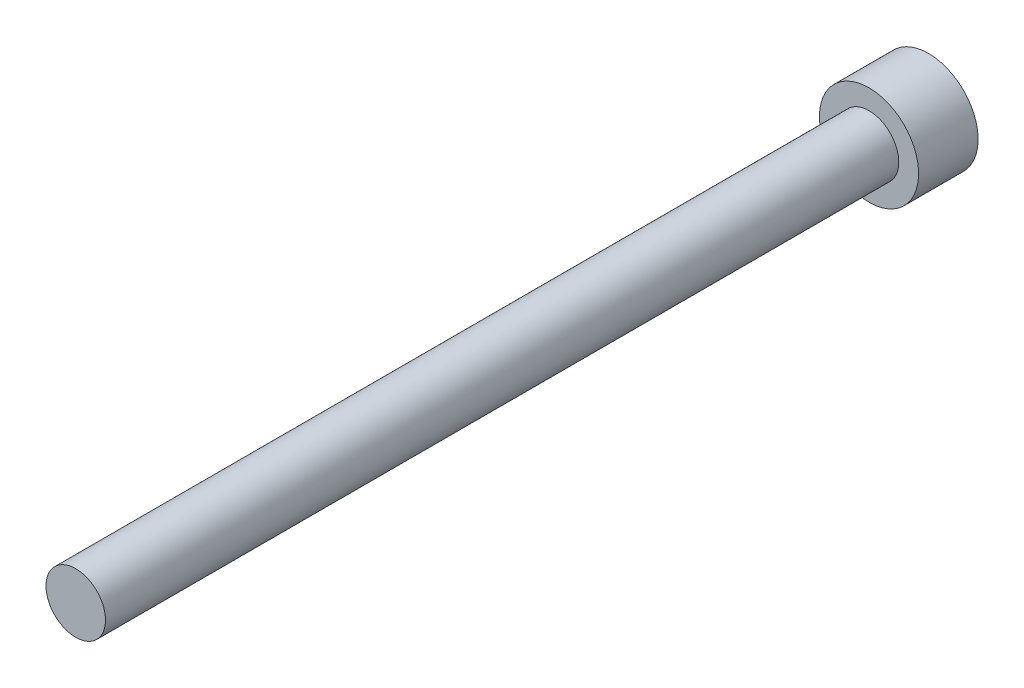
ISO-10303-21;
HEADER;
FILE_DESCRIPTION(('STEP AP214'),'2;1');
FILE_NAME('part.step','',(''),(''),'','','');
FILE_SCHEMA(('AUTOMOTIVE_DESIGN { 1 0 10303 214 1 1 1 1 }'));
ENDSEC;
DATA;
#1=APPLICATION_CONTEXT('core data for automotive mechanical design processes');
#2=APPLICATION_PROTOCOL_DEFINITION('international standard','automotive_design',2000,#1);
#3=PRODUCT_CONTEXT('',#1,'mechanical');
#4=PRODUCT('Part','Part','',(#3));
#5=PRODUCT_RELATED_PRODUCT_CATEGORY('part','',(#4));
#6=PRODUCT_DEFINITION_FORMATION('','',#4);
#7=PRODUCT_DEFINITION_CONTEXT('part definition',#1,'design');
#8=PRODUCT_DEFINITION('design','',#6,#7);
#9=PRODUCT_DEFINITION_SHAPE('','',#8);
#10=(LENGTH_UNIT() NAMED_UNIT(*) SI_UNIT(.MILLI.,.METRE.));
#11=(NAMED_UNIT(*) PLANE_ANGLE_UNIT() SI_UNIT($,.RADIAN.));
#12=(NAMED_UNIT(*) SI_UNIT($,.STERADIAN.) SOLID_ANGLE_UNIT());
#13=UNCERTAINTY_MEASURE_WITH_UNIT(LENGTH_MEASURE(1.E-05),#10,'distance_accuracy_value','');
#14=(GEOMETRIC_REPRESENTATION_CONTEXT(3) GLOBAL_UNCERTAINTY_ASSIGNED_CONTEXT((#13)) GLOBAL_UNIT_ASSIGNED_CONTEXT((#10,
#11,#12)) REPRESENTATION_CONTEXT('',''));
#15=CARTESIAN_POINT('',(0.,0.,0.));
#16=DIRECTION('',(0.,0.,1.));
#17=DIRECTION('',(1.,0.,0.));
#18=AXIS2_PLACEMENT_3D('',#15,#16,#17);
#19=CARTESIAN_POINT('',(0.,0.,43.0004928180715));
#20=DIRECTION('',(0.,0.,-1.));
#21=DIRECTION('',(-1.,0.,0.));
#22=AXIS2_PLACEMENT_3D('',#19,#20,#21);
#23=CYLINDRICAL_SURFACE('',#22,1.5);
#24=CARTESIAN_POINT('',(0.,0.,43.));
#25=DIRECTION('',(0.,0.,-1.));
#26=DIRECTION('',(-1.,0.,0.));
#27=AXIS2_PLACEMENT_3D('',#24,#25,#26);
#28=CIRCLE('',#27,1.5);
#29=CARTESIAN_POINT('',(-1.5,0.,43.));
#30=VERTEX_POINT('',#29);
#31=EDGE_CURVE('E10',#30,#30,#28,.T.);
#32=ORIENTED_EDGE('',*,*,#31,.T.);
#33=EDGE_LOOP('',(#32));
#34=FACE_BOUND('',#33,.T.);
#35=CARTESIAN_POINT('',(0.,0.,3.));
#36=DIRECTION('',(0.,0.,-1.));
#37=DIRECTION('',(-1.,0.,0.));
#38=AXIS2_PLACEMENT_3D('',#35,#36,#37);
#39=CIRCLE('',#38,1.5);
#40=CARTESIAN_POINT('',(-1.5,0.,3.));
#41=VERTEX_POINT('',#40);
#42=EDGE_CURVE('E45',#41,#41,#39,.T.);
#43=ORIENTED_EDGE('',*,*,#42,.F.);
#44=EDGE_LOOP('',(#43));
#45=FACE_BOUND('',#44,.T.);
#46=ADVANCED_FACE('F31',(#34,#45),#23,.T.);
#47=CARTESIAN_POINT('',(1.5,0.,43.));
#48=DIRECTION('',(0.,0.,1.));
#49=DIRECTION('',(1.,0.,0.));
#50=AXIS2_PLACEMENT_3D('',#47,#48,#49);
#51=PLANE('',#50);
#52=ORIENTED_EDGE('',*,*,#31,.F.);
#53=EDGE_LOOP('',(#52));
#54=FACE_BOUND('',#53,.T.);
#55=ADVANCED_FACE('F55',(#54),#51,.T.);
#56=CARTESIAN_POINT('',(0.,0.,0.));
#57=DIRECTION('',(0.,0.,-1.));
#58=DIRECTION('',(-1.,0.,0.));
#59=AXIS2_PLACEMENT_3D('',#56,#57,#58);
#60=PLANE('',#59);
#61=CARTESIAN_POINT('',(0.,0.,0.));
#62=DIRECTION('',(0.,0.,-1.));
#63=DIRECTION('',(-1.,0.,0.));
#64=AXIS2_PLACEMENT_3D('',#61,#62,#63);
#65=CIRCLE('',#64,2.5);
#66=CARTESIAN_POINT('',(-2.5,0.,0.));
#67=VERTEX_POINT('',#66);
#68=EDGE_CURVE('E37',#67,#67,#65,.T.);
#69=ORIENTED_EDGE('',*,*,#68,.T.);
#70=EDGE_LOOP('',(#69));
#71=FACE_BOUND('',#70,.T.);
#72=ADVANCED_FACE('F59',(#71),#60,.T.);
#73=CARTESIAN_POINT('',(0.,0.,43.0004928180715));
#74=DIRECTION('',(0.,0.,-1.));
#75=DIRECTION('',(-1.,0.,0.));
#76=AXIS2_PLACEMENT_3D('',#73,#74,#75);
#77=CYLINDRICAL_SURFACE('',#76,2.5);
#78=CARTESIAN_POINT('',(0.,0.,3.));
#79=DIRECTION('',(0.,0.,-1.));
#80=DIRECTION('',(-1.,0.,0.));
#81=AXIS2_PLACEMENT_3D('',#78,#79,#80);
#82=CIRCLE('',#81,2.5);
#83=CARTESIAN_POINT('',(-2.5,0.,3.));
#84=VERTEX_POINT('',#83);
#85=EDGE_CURVE('E41',#84,#84,#82,.T.);
#86=ORIENTED_EDGE('',*,*,#85,.T.);
#87=EDGE_LOOP('',(#86));
#88=FACE_BOUND('',#87,.T.);
#89=ORIENTED_EDGE('',*,*,#68,.F.);
#90=EDGE_LOOP('',(#89));
#91=FACE_BOUND('',#90,.T.);
#92=ADVANCED_FACE('F64',(#88,#91),#77,.T.);
#93=CARTESIAN_POINT('',(2.5,0.,3.));
#94=DIRECTION('',(0.,0.,1.));
#95=DIRECTION('',(1.,0.,0.));
#96=AXIS2_PLACEMENT_3D('',#93,#94,#95);
#97=PLANE('',#96);
#98=ORIENTED_EDGE('',*,*,#42,.T.);
#99=EDGE_LOOP('',(#98));
#100=FACE_BOUND('',#99,.T.);
#101=ORIENTED_EDGE('',*,*,#85,.F.);
#102=EDGE_LOOP('',(#101));
#103=FACE_BOUND('',#102,.T.);
#104=ADVANCED_FACE('F51',(#100,#103),#97,.T.);
#105=CLOSED_SHELL('',(#46,#55,#72,#92,#104));
#106=MANIFOLD_SOLID_BREP('B2',#105);
#107=ADVANCED_BREP_SHAPE_REPRESENTATION('',(#18,#106),#14);
#108=SHAPE_DEFINITION_REPRESENTATION(#9,#107);
ENDSEC;
END-ISO-10303-21;
